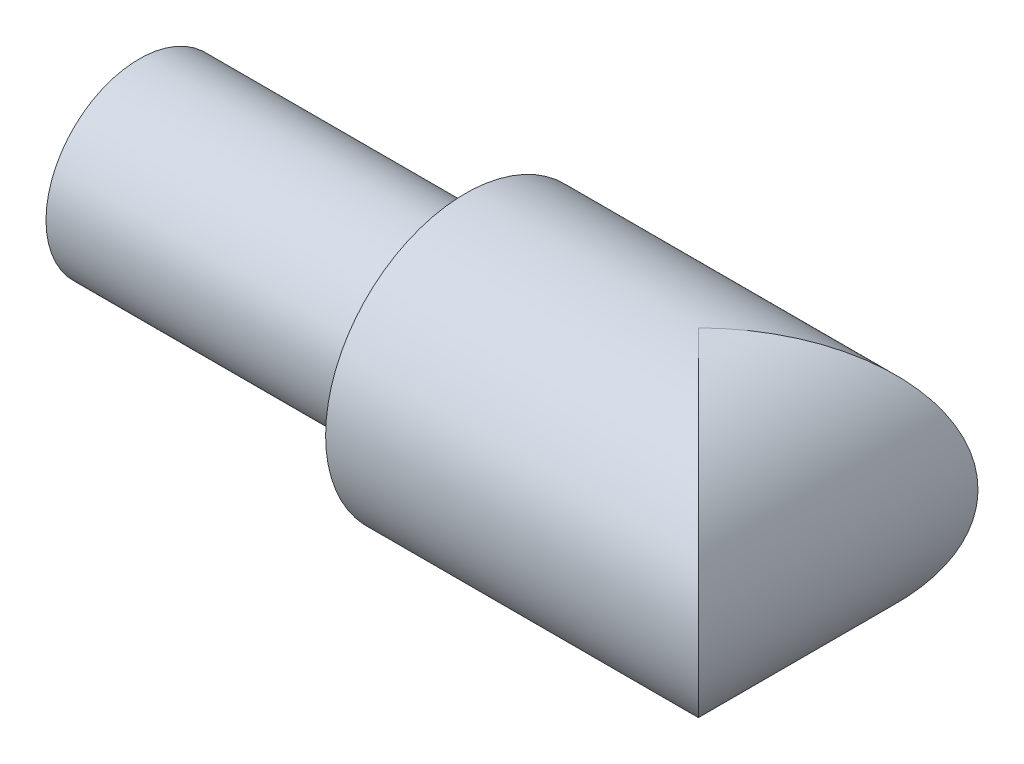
ISO-10303-21;
HEADER;
FILE_DESCRIPTION(('STEP AP214'),'2;1');
FILE_NAME('part.step','',(''),(''),'','','');
FILE_SCHEMA(('AUTOMOTIVE_DESIGN { 1 0 10303 214 1 1 1 1 }'));
ENDSEC;
DATA;
#1=APPLICATION_CONTEXT('core data for automotive mechanical design processes');
#2=APPLICATION_PROTOCOL_DEFINITION('international standard','automotive_design',2000,#1);
#3=PRODUCT_CONTEXT('',#1,'mechanical');
#4=PRODUCT('Part','Part','',(#3));
#5=PRODUCT_RELATED_PRODUCT_CATEGORY('part','',(#4));
#6=PRODUCT_DEFINITION_FORMATION('','',#4);
#7=PRODUCT_DEFINITION_CONTEXT('part definition',#1,'design');
#8=PRODUCT_DEFINITION('design','',#6,#7);
#9=PRODUCT_DEFINITION_SHAPE('','',#8);
#10=(LENGTH_UNIT() NAMED_UNIT(*) SI_UNIT(.MILLI.,.METRE.));
#11=(NAMED_UNIT(*) PLANE_ANGLE_UNIT() SI_UNIT($,.RADIAN.));
#12=(NAMED_UNIT(*) SI_UNIT($,.STERADIAN.) SOLID_ANGLE_UNIT());
#13=UNCERTAINTY_MEASURE_WITH_UNIT(LENGTH_MEASURE(1.E-05),#10,'distance_accuracy_value','');
#14=(GEOMETRIC_REPRESENTATION_CONTEXT(3) GLOBAL_UNCERTAINTY_ASSIGNED_CONTEXT((#13)) GLOBAL_UNIT_ASSIGNED_CONTEXT((#10,
#11,#12)) REPRESENTATION_CONTEXT('',''));
#15=CARTESIAN_POINT('',(0.,0.,0.));
#16=DIRECTION('',(0.,0.,1.));
#17=DIRECTION('',(1.,0.,0.));
#18=AXIS2_PLACEMENT_3D('',#15,#16,#17);
#19=CARTESIAN_POINT('',(-6.99999999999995,0.,0.));
#20=DIRECTION('',(1.,0.,0.));
#21=DIRECTION('',(0.,0.,-1.));
#22=AXIS2_PLACEMENT_3D('',#19,#20,#21);
#23=PLANE('',#22);
#24=CARTESIAN_POINT('',(-6.99999999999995,0.,0.));
#25=DIRECTION('',(1.,0.,0.));
#26=DIRECTION('',(0.,0.,-1.));
#27=AXIS2_PLACEMENT_3D('',#24,#25,#26);
#28=CIRCLE('',#27,2.);
#29=CARTESIAN_POINT('',(-6.99999999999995,0.,-2.));
#30=VERTEX_POINT('',#29);
#31=EDGE_CURVE('E19',#30,#30,#28,.T.);
#32=ORIENTED_EDGE('',*,*,#31,.F.);
#33=EDGE_LOOP('',(#32));
#34=FACE_BOUND('',#33,.T.);
#35=ADVANCED_FACE('F16',(#34),#23,.F.);
#36=CARTESIAN_POINT('',(-7.74999999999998,0.,0.));
#37=DIRECTION('',(1.,0.,0.));
#38=DIRECTION('',(0.,0.,-1.));
#39=AXIS2_PLACEMENT_3D('',#36,#37,#38);
#40=CYLINDRICAL_SURFACE('',#39,2.);
#41=ORIENTED_EDGE('',*,*,#31,.T.);
#42=EDGE_LOOP('',(#41));
#43=FACE_BOUND('',#42,.T.);
#44=CARTESIAN_POINT('',(0.,0.,0.));
#45=DIRECTION('',(1.,0.,0.));
#46=DIRECTION('',(0.,0.,-1.));
#47=AXIS2_PLACEMENT_3D('',#44,#45,#46);
#48=CIRCLE('',#47,2.);
#49=CARTESIAN_POINT('',(0.,0.,-2.));
#50=VERTEX_POINT('',#49);
#51=EDGE_CURVE('E42',#50,#50,#48,.F.);
#52=ORIENTED_EDGE('',*,*,#51,.T.);
#53=EDGE_LOOP('',(#52));
#54=FACE_BOUND('',#53,.T.);
#55=ADVANCED_FACE('F50',(#43,#54),#40,.T.);
#56=CARTESIAN_POINT('',(0.,0.,0.));
#57=DIRECTION('',(1.,0.,0.));
#58=DIRECTION('',(0.,0.,-1.));
#59=AXIS2_PLACEMENT_3D('',#56,#57,#58);
#60=PLANE('',#59);
#61=CARTESIAN_POINT('',(0.,0.,0.));
#62=DIRECTION('',(1.,0.,0.));
#63=DIRECTION('',(0.,0.,-1.));
#64=AXIS2_PLACEMENT_3D('',#61,#62,#63);
#65=CIRCLE('',#64,3.);
#66=CARTESIAN_POINT('',(0.,0.,-3.));
#67=VERTEX_POINT('',#66);
#68=EDGE_CURVE('E33',#67,#67,#65,.T.);
#69=ORIENTED_EDGE('',*,*,#68,.F.);
#70=EDGE_LOOP('',(#69));
#71=FACE_BOUND('',#70,.T.);
#72=ORIENTED_EDGE('',*,*,#51,.F.);
#73=EDGE_LOOP('',(#72));
#74=FACE_BOUND('',#73,.T.);
#75=ADVANCED_FACE('F57',(#71,#74),#60,.F.);
#76=CARTESIAN_POINT('',(5.,0.,3.60000000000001));
#77=DIRECTION('',(0.,0.,1.));
#78=DIRECTION('',(0.,-1.,0.));
#79=AXIS2_PLACEMENT_3D('',#76,#77,#78);
#80=CYLINDRICAL_SURFACE('',#79,3.);
#81=CARTESIAN_POINT('',(5.,0.,0.));
#82=DIRECTION('',(0.707106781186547,0.,0.707106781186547));
#83=DIRECTION('',(0.707106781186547,0.,-0.707106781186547));
#84=AXIS2_PLACEMENT_3D('',#81,#82,#83);
#85=ELLIPSE('',#84,4.24264068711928,3.);
#86=CARTESIAN_POINT('',(5.,3.,0.));
#87=VERTEX_POINT('',#86);
#88=CARTESIAN_POINT('',(5.,-3.,0.));
#89=VERTEX_POINT('',#88);
#90=EDGE_CURVE('E11',#87,#89,#85,.F.);
#91=ORIENTED_EDGE('',*,*,#90,.F.);
#92=CARTESIAN_POINT('',(5.,0.,0.));
#93=DIRECTION('',(0.707106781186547,0.,-0.707106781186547));
#94=DIRECTION('',(0.707106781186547,0.,0.707106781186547));
#95=AXIS2_PLACEMENT_3D('',#92,#93,#94);
#96=ELLIPSE('',#95,4.24264068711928,3.);
#97=EDGE_CURVE('E25',#89,#87,#96,.F.);
#98=ORIENTED_EDGE('',*,*,#97,.F.);
#99=EDGE_LOOP('',(#91,#98));
#100=FACE_BOUND('',#99,.T.);
#101=ADVANCED_FACE('F31',(#100),#80,.T.);
#102=CARTESIAN_POINT('',(-7.74999999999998,0.,0.));
#103=DIRECTION('',(1.,0.,0.));
#104=DIRECTION('',(0.,0.,-1.));
#105=AXIS2_PLACEMENT_3D('',#102,#103,#104);
#106=CYLINDRICAL_SURFACE('',#105,3.);
#107=ORIENTED_EDGE('',*,*,#90,.T.);
#108=ORIENTED_EDGE('',*,*,#97,.T.);
#109=EDGE_LOOP('',(#107,#108));
#110=FACE_BOUND('',#109,.T.);
#111=ORIENTED_EDGE('',*,*,#68,.T.);
#112=EDGE_LOOP('',(#111));
#113=FACE_BOUND('',#112,.T.);
#114=ADVANCED_FACE('F35',(#110,#113),#106,.T.);
#115=CLOSED_SHELL('',(#35,#55,#75,#101,#114));
#116=MANIFOLD_SOLID_BREP('B1',#115);
#117=ADVANCED_BREP_SHAPE_REPRESENTATION('',(#18,#116),#14);
#118=SHAPE_DEFINITION_REPRESENTATION(#9,#117);
ENDSEC;
END-ISO-10303-21;
